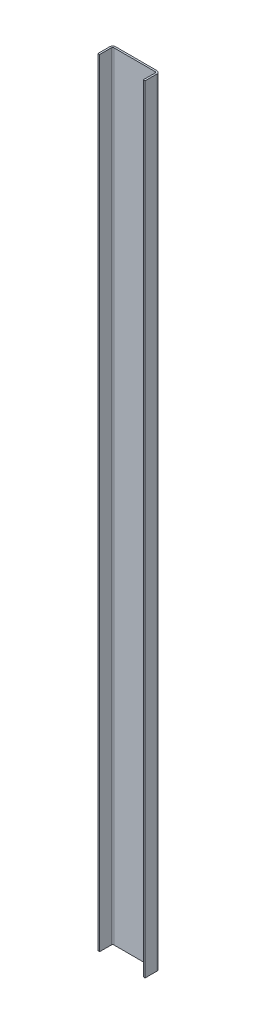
ISO-10303-21;
HEADER;
FILE_DESCRIPTION(('STEP AP214'),'2;1');
FILE_NAME('part.step','',(''),(''),'','','');
FILE_SCHEMA(('AUTOMOTIVE_DESIGN { 1 0 10303 214 1 1 1 1 }'));
ENDSEC;
DATA;
#1=APPLICATION_CONTEXT('core data for automotive mechanical design processes');
#2=APPLICATION_PROTOCOL_DEFINITION('international standard','automotive_design',2000,#1);
#3=PRODUCT_CONTEXT('',#1,'mechanical');
#4=PRODUCT('Part','Part','',(#3));
#5=PRODUCT_RELATED_PRODUCT_CATEGORY('part','',(#4));
#6=PRODUCT_DEFINITION_FORMATION('','',#4);
#7=PRODUCT_DEFINITION_CONTEXT('part definition',#1,'design');
#8=PRODUCT_DEFINITION('design','',#6,#7);
#9=PRODUCT_DEFINITION_SHAPE('','',#8);
#10=(LENGTH_UNIT() NAMED_UNIT(*) SI_UNIT(.MILLI.,.METRE.));
#11=(NAMED_UNIT(*) PLANE_ANGLE_UNIT() SI_UNIT($,.RADIAN.));
#12=(NAMED_UNIT(*) SI_UNIT($,.STERADIAN.) SOLID_ANGLE_UNIT());
#13=UNCERTAINTY_MEASURE_WITH_UNIT(LENGTH_MEASURE(1.E-05),#10,'distance_accuracy_value','');
#14=(GEOMETRIC_REPRESENTATION_CONTEXT(3) GLOBAL_UNCERTAINTY_ASSIGNED_CONTEXT((#13)) GLOBAL_UNIT_ASSIGNED_CONTEXT((#10,
#11,#12)) REPRESENTATION_CONTEXT('',''));
#15=CARTESIAN_POINT('',(0.,0.,0.));
#16=DIRECTION('',(0.,0.,1.));
#17=DIRECTION('',(1.,0.,0.));
#18=AXIS2_PLACEMENT_3D('',#15,#16,#17);
#19=CARTESIAN_POINT('',(40.,658.,0.));
#20=DIRECTION('',(-1.,0.,0.));
#21=DIRECTION('',(0.,0.,1.));
#22=AXIS2_PLACEMENT_3D('',#19,#20,#21);
#23=PLANE('',#22);
#24=DIRECTION('',(0.,1.,0.));
#25=VECTOR('',#24,1.);
#26=CARTESIAN_POINT('',(40.,658.,0.));
#27=LINE('',#26,#25);
#28=CARTESIAN_POINT('',(40.,658.,0.));
#29=VERTEX_POINT('',#28);
#30=CARTESIAN_POINT('',(40.,0.,0.));
#31=VERTEX_POINT('',#30);
#32=EDGE_CURVE('E147',#29,#31,#27,.F.);
#33=ORIENTED_EDGE('',*,*,#32,.T.);
#34=DIRECTION('',(0.,0.,1.));
#35=VECTOR('',#34,1.);
#36=CARTESIAN_POINT('',(40.,0.,0.));
#37=LINE('',#36,#35);
#38=CARTESIAN_POINT('',(40.,0.,-10.));
#39=VERTEX_POINT('',#38);
#40=EDGE_CURVE('E158',#31,#39,#37,.F.);
#41=ORIENTED_EDGE('',*,*,#40,.T.);
#42=DIRECTION('',(0.,1.,0.));
#43=VECTOR('',#42,1.);
#44=CARTESIAN_POINT('',(40.,658.,-10.));
#45=LINE('',#44,#43);
#46=CARTESIAN_POINT('',(40.,658.,-10.));
#47=VERTEX_POINT('',#46);
#48=EDGE_CURVE('E112',#47,#39,#45,.F.);
#49=ORIENTED_EDGE('',*,*,#48,.F.);
#50=DIRECTION('',(0.,0.,1.));
#51=VECTOR('',#50,1.);
#52=CARTESIAN_POINT('',(40.,658.,0.));
#53=LINE('',#52,#51);
#54=EDGE_CURVE('E119',#29,#47,#53,.F.);
#55=ORIENTED_EDGE('',*,*,#54,.F.);
#56=EDGE_LOOP('',(#33,#41,#49,#55));
#57=FACE_BOUND('',#56,.T.);
#58=ADVANCED_FACE('F17',(#57),#23,.F.);
#59=CARTESIAN_POINT('',(0.,658.,0.));
#60=DIRECTION('',(1.,0.,0.));
#61=DIRECTION('',(0.,0.,-1.));
#62=AXIS2_PLACEMENT_3D('',#59,#60,#61);
#63=PLANE('',#62);
#64=DIRECTION('',(0.,1.,0.));
#65=VECTOR('',#64,1.);
#66=CARTESIAN_POINT('',(0.,658.,0.));
#67=LINE('',#66,#65);
#68=CARTESIAN_POINT('',(0.,658.,0.));
#69=VERTEX_POINT('',#68);
#70=CARTESIAN_POINT('',(0.,0.,0.));
#71=VERTEX_POINT('',#70);
#72=EDGE_CURVE('E190',#69,#71,#67,.F.);
#73=ORIENTED_EDGE('',*,*,#72,.F.);
#74=DIRECTION('',(0.,0.,1.));
#75=VECTOR('',#74,1.);
#76=CARTESIAN_POINT('',(0.,658.,0.));
#77=LINE('',#76,#75);
#78=CARTESIAN_POINT('',(0.,658.,-10.));
#79=VERTEX_POINT('',#78);
#80=EDGE_CURVE('E194',#79,#69,#77,.T.);
#81=ORIENTED_EDGE('',*,*,#80,.F.);
#82=DIRECTION('',(0.,1.,0.));
#83=VECTOR('',#82,1.);
#84=CARTESIAN_POINT('',(0.,658.,-10.));
#85=LINE('',#84,#83);
#86=CARTESIAN_POINT('',(0.,0.,-10.));
#87=VERTEX_POINT('',#86);
#88=EDGE_CURVE('E108',#87,#79,#85,.T.);
#89=ORIENTED_EDGE('',*,*,#88,.F.);
#90=DIRECTION('',(0.,0.,1.));
#91=VECTOR('',#90,1.);
#92=CARTESIAN_POINT('',(0.,0.,0.));
#93=LINE('',#92,#91);
#94=EDGE_CURVE('E197',#87,#71,#93,.T.);
#95=ORIENTED_EDGE('',*,*,#94,.T.);
#96=EDGE_LOOP('',(#73,#81,#89,#95));
#97=FACE_BOUND('',#96,.T.);
#98=ADVANCED_FACE('F240',(#97),#63,.F.);
#99=CARTESIAN_POINT('',(38.5,658.,0.));
#100=DIRECTION('',(0.,0.,-1.));
#101=DIRECTION('',(-1.,0.,0.));
#102=AXIS2_PLACEMENT_3D('',#99,#100,#101);
#103=PLANE('',#102);
#104=ORIENTED_EDGE('',*,*,#32,.F.);
#105=DIRECTION('',(-1.,0.,0.));
#106=VECTOR('',#105,1.);
#107=CARTESIAN_POINT('',(38.5,658.,0.));
#108=LINE('',#107,#106);
#109=CARTESIAN_POINT('',(38.5,658.,0.));
#110=VERTEX_POINT('',#109);
#111=EDGE_CURVE('E150',#110,#29,#108,.F.);
#112=ORIENTED_EDGE('',*,*,#111,.F.);
#113=DIRECTION('',(0.,1.,0.));
#114=VECTOR('',#113,1.);
#115=CARTESIAN_POINT('',(38.5,658.,0.));
#116=LINE('',#115,#114);
#117=CARTESIAN_POINT('',(38.5,0.,0.));
#118=VERTEX_POINT('',#117);
#119=EDGE_CURVE('E133',#118,#110,#116,.T.);
#120=ORIENTED_EDGE('',*,*,#119,.F.);
#121=DIRECTION('',(-1.,0.,0.));
#122=VECTOR('',#121,1.);
#123=CARTESIAN_POINT('',(38.5,0.,0.));
#124=LINE('',#123,#122);
#125=EDGE_CURVE('E115',#31,#118,#124,.T.);
#126=ORIENTED_EDGE('',*,*,#125,.F.);
#127=EDGE_LOOP('',(#104,#112,#120,#126));
#128=FACE_BOUND('',#127,.T.);
#129=ADVANCED_FACE('F250',(#128),#103,.F.);
#130=CARTESIAN_POINT('',(37.5,658.,-10.));
#131=DIRECTION('',(0.,1.,0.));
#132=DIRECTION('',(0.,0.,1.));
#133=AXIS2_PLACEMENT_3D('',#130,#131,#132);
#134=CYLINDRICAL_SURFACE('',#133,2.5);
#135=CARTESIAN_POINT('',(37.5,0.,-10.));
#136=DIRECTION('',(0.,1.,0.));
#137=DIRECTION('',(0.,0.,1.));
#138=AXIS2_PLACEMENT_3D('',#135,#136,#137);
#139=CIRCLE('',#138,2.5);
#140=CARTESIAN_POINT('',(37.5,0.,-12.5));
#141=VERTEX_POINT('',#140);
#142=EDGE_CURVE('E110',#39,#141,#139,.T.);
#143=ORIENTED_EDGE('',*,*,#142,.T.);
#144=DIRECTION('',(0.,1.,0.));
#145=VECTOR('',#144,1.);
#146=CARTESIAN_POINT('',(37.5,658.,-12.5));
#147=LINE('',#146,#145);
#148=CARTESIAN_POINT('',(37.5,658.,-12.5));
#149=VERTEX_POINT('',#148);
#150=EDGE_CURVE('E187',#141,#149,#147,.T.);
#151=ORIENTED_EDGE('',*,*,#150,.T.);
#152=CARTESIAN_POINT('',(37.5,658.,-10.));
#153=DIRECTION('',(0.,1.,0.));
#154=DIRECTION('',(0.,0.,1.));
#155=AXIS2_PLACEMENT_3D('',#152,#153,#154);
#156=CIRCLE('',#155,2.5);
#157=EDGE_CURVE('E113',#149,#47,#156,.F.);
#158=ORIENTED_EDGE('',*,*,#157,.T.);
#159=ORIENTED_EDGE('',*,*,#48,.T.);
#160=EDGE_LOOP('',(#143,#151,#158,#159));
#161=FACE_BOUND('',#160,.T.);
#162=ADVANCED_FACE('F213',(#161),#134,.T.);
#163=CARTESIAN_POINT('',(2.5,658.,-10.));
#164=DIRECTION('',(0.,1.,0.));
#165=DIRECTION('',(0.,0.,1.));
#166=AXIS2_PLACEMENT_3D('',#163,#164,#165);
#167=CYLINDRICAL_SURFACE('',#166,2.5);
#168=CARTESIAN_POINT('',(2.5,0.,-10.));
#169=DIRECTION('',(0.,1.,0.));
#170=DIRECTION('',(0.,0.,1.));
#171=AXIS2_PLACEMENT_3D('',#168,#169,#170);
#172=CIRCLE('',#171,2.5);
#173=CARTESIAN_POINT('',(2.5,0.,-12.5));
#174=VERTEX_POINT('',#173);
#175=EDGE_CURVE('E105',#174,#87,#172,.T.);
#176=ORIENTED_EDGE('',*,*,#175,.T.);
#177=ORIENTED_EDGE('',*,*,#88,.T.);
#178=CARTESIAN_POINT('',(2.5,658.,-10.));
#179=DIRECTION('',(0.,1.,0.));
#180=DIRECTION('',(0.,0.,1.));
#181=AXIS2_PLACEMENT_3D('',#178,#179,#180);
#182=CIRCLE('',#181,2.5);
#183=CARTESIAN_POINT('',(2.5,658.,-12.5));
#184=VERTEX_POINT('',#183);
#185=EDGE_CURVE('E35',#79,#184,#182,.F.);
#186=ORIENTED_EDGE('',*,*,#185,.T.);
#187=DIRECTION('',(0.,1.,0.));
#188=VECTOR('',#187,1.);
#189=CARTESIAN_POINT('',(2.5,658.,-12.5));
#190=LINE('',#189,#188);
#191=EDGE_CURVE('E170',#184,#174,#190,.F.);
#192=ORIENTED_EDGE('',*,*,#191,.T.);
#193=EDGE_LOOP('',(#176,#177,#186,#192));
#194=FACE_BOUND('',#193,.T.);
#195=ADVANCED_FACE('F241',(#194),#167,.T.);
#196=CARTESIAN_POINT('',(1.5,658.,0.));
#197=DIRECTION('',(0.,0.,1.));
#198=DIRECTION('',(1.,0.,0.));
#199=AXIS2_PLACEMENT_3D('',#196,#197,#198);
#200=PLANE('',#199);
#201=DIRECTION('',(1.,0.,0.));
#202=VECTOR('',#201,1.);
#203=CARTESIAN_POINT('',(1.5,0.,0.));
#204=LINE('',#203,#202);
#205=CARTESIAN_POINT('',(1.5,0.,0.));
#206=VERTEX_POINT('',#205);
#207=EDGE_CURVE('E162',#71,#206,#204,.T.);
#208=ORIENTED_EDGE('',*,*,#207,.T.);
#209=DIRECTION('',(0.,1.,0.));
#210=VECTOR('',#209,1.);
#211=CARTESIAN_POINT('',(1.5,658.,0.));
#212=LINE('',#211,#210);
#213=CARTESIAN_POINT('',(1.5,658.,0.));
#214=VERTEX_POINT('',#213);
#215=EDGE_CURVE('E143',#214,#206,#212,.F.);
#216=ORIENTED_EDGE('',*,*,#215,.F.);
#217=DIRECTION('',(1.,0.,0.));
#218=VECTOR('',#217,1.);
#219=CARTESIAN_POINT('',(1.5,658.,0.));
#220=LINE('',#219,#218);
#221=EDGE_CURVE('E181',#214,#69,#220,.F.);
#222=ORIENTED_EDGE('',*,*,#221,.T.);
#223=ORIENTED_EDGE('',*,*,#72,.T.);
#224=EDGE_LOOP('',(#208,#216,#222,#223));
#225=FACE_BOUND('',#224,.T.);
#226=ADVANCED_FACE('F238',(#225),#200,.T.);
#227=CARTESIAN_POINT('',(38.5,658.,0.));
#228=DIRECTION('',(-1.,0.,0.));
#229=DIRECTION('',(0.,0.,1.));
#230=AXIS2_PLACEMENT_3D('',#227,#228,#229);
#231=PLANE('',#230);
#232=DIRECTION('',(0.,0.,1.));
#233=VECTOR('',#232,1.);
#234=CARTESIAN_POINT('',(38.5,0.,0.));
#235=LINE('',#234,#233);
#236=CARTESIAN_POINT('',(38.5,0.,-10.));
#237=VERTEX_POINT('',#236);
#238=EDGE_CURVE('E126',#237,#118,#235,.T.);
#239=ORIENTED_EDGE('',*,*,#238,.T.);
#240=ORIENTED_EDGE('',*,*,#119,.T.);
#241=DIRECTION('',(0.,0.,1.));
#242=VECTOR('',#241,1.);
#243=CARTESIAN_POINT('',(38.5,658.,0.));
#244=LINE('',#243,#242);
#245=CARTESIAN_POINT('',(38.5,658.,-10.));
#246=VERTEX_POINT('',#245);
#247=EDGE_CURVE('E134',#110,#246,#244,.F.);
#248=ORIENTED_EDGE('',*,*,#247,.T.);
#249=DIRECTION('',(0.,1.,0.));
#250=VECTOR('',#249,1.);
#251=CARTESIAN_POINT('',(38.5,658.,-10.));
#252=LINE('',#251,#250);
#253=EDGE_CURVE('E83',#246,#237,#252,.F.);
#254=ORIENTED_EDGE('',*,*,#253,.T.);
#255=EDGE_LOOP('',(#239,#240,#248,#254));
#256=FACE_BOUND('',#255,.T.);
#257=ADVANCED_FACE('F136',(#256),#231,.T.);
#258=CARTESIAN_POINT('',(0.,658.,-12.5));
#259=DIRECTION('',(0.,0.,1.));
#260=DIRECTION('',(1.,0.,0.));
#261=AXIS2_PLACEMENT_3D('',#258,#259,#260);
#262=PLANE('',#261);
#263=ORIENTED_EDGE('',*,*,#191,.F.);
#264=DIRECTION('',(1.,0.,0.));
#265=VECTOR('',#264,1.);
#266=CARTESIAN_POINT('',(0.,658.,-12.5));
#267=LINE('',#266,#265);
#268=EDGE_CURVE('E137',#149,#184,#267,.F.);
#269=ORIENTED_EDGE('',*,*,#268,.F.);
#270=ORIENTED_EDGE('',*,*,#150,.F.);
#271=DIRECTION('',(1.,0.,0.));
#272=VECTOR('',#271,1.);
#273=CARTESIAN_POINT('',(0.,0.,-12.5));
#274=LINE('',#273,#272);
#275=EDGE_CURVE('E138',#141,#174,#274,.F.);
#276=ORIENTED_EDGE('',*,*,#275,.T.);
#277=EDGE_LOOP('',(#263,#269,#270,#276));
#278=FACE_BOUND('',#277,.T.);
#279=ADVANCED_FACE('F218',(#278),#262,.F.);
#280=CARTESIAN_POINT('',(1.5,658.,0.));
#281=DIRECTION('',(1.,0.,0.));
#282=DIRECTION('',(0.,0.,-1.));
#283=AXIS2_PLACEMENT_3D('',#280,#281,#282);
#284=PLANE('',#283);
#285=DIRECTION('',(0.,0.,-1.));
#286=VECTOR('',#285,1.);
#287=CARTESIAN_POINT('',(1.5,658.,0.));
#288=LINE('',#287,#286);
#289=CARTESIAN_POINT('',(1.5,658.,-10.));
#290=VERTEX_POINT('',#289);
#291=EDGE_CURVE('E102',#290,#214,#288,.F.);
#292=ORIENTED_EDGE('',*,*,#291,.T.);
#293=ORIENTED_EDGE('',*,*,#215,.T.);
#294=DIRECTION('',(0.,0.,-1.));
#295=VECTOR('',#294,1.);
#296=CARTESIAN_POINT('',(1.5,0.,0.));
#297=LINE('',#296,#295);
#298=CARTESIAN_POINT('',(1.5,0.,-10.));
#299=VERTEX_POINT('',#298);
#300=EDGE_CURVE('E168',#206,#299,#297,.T.);
#301=ORIENTED_EDGE('',*,*,#300,.T.);
#302=DIRECTION('',(0.,1.,0.));
#303=VECTOR('',#302,1.);
#304=CARTESIAN_POINT('',(1.5,658.,-10.));
#305=LINE('',#304,#303);
#306=EDGE_CURVE('E140',#299,#290,#305,.T.);
#307=ORIENTED_EDGE('',*,*,#306,.T.);
#308=EDGE_LOOP('',(#292,#293,#301,#307));
#309=FACE_BOUND('',#308,.T.);
#310=ADVANCED_FACE('F174',(#309),#284,.T.);
#311=CARTESIAN_POINT('',(0.,0.,-11.));
#312=DIRECTION('',(0.,1.,0.));
#313=DIRECTION('',(0.,0.,1.));
#314=AXIS2_PLACEMENT_3D('',#311,#312,#313);
#315=PLANE('',#314);
#316=ORIENTED_EDGE('',*,*,#275,.F.);
#317=ORIENTED_EDGE('',*,*,#142,.F.);
#318=ORIENTED_EDGE('',*,*,#40,.F.);
#319=ORIENTED_EDGE('',*,*,#125,.T.);
#320=ORIENTED_EDGE('',*,*,#238,.F.);
#321=CARTESIAN_POINT('',(37.5,0.,-10.));
#322=DIRECTION('',(0.,1.,0.));
#323=DIRECTION('',(0.,0.,1.));
#324=AXIS2_PLACEMENT_3D('',#321,#322,#323);
#325=CIRCLE('',#324,1.);
#326=CARTESIAN_POINT('',(37.5,0.,-11.));
#327=VERTEX_POINT('',#326);
#328=EDGE_CURVE('E88',#237,#327,#325,.T.);
#329=ORIENTED_EDGE('',*,*,#328,.T.);
#330=DIRECTION('',(1.,0.,0.));
#331=VECTOR('',#330,1.);
#332=CARTESIAN_POINT('',(0.,0.,-11.));
#333=LINE('',#332,#331);
#334=CARTESIAN_POINT('',(2.5,0.,-11.));
#335=VERTEX_POINT('',#334);
#336=EDGE_CURVE('E93',#335,#327,#333,.T.);
#337=ORIENTED_EDGE('',*,*,#336,.F.);
#338=CARTESIAN_POINT('',(2.5,0.,-10.));
#339=DIRECTION('',(0.,1.,0.));
#340=DIRECTION('',(0.,0.,1.));
#341=AXIS2_PLACEMENT_3D('',#338,#339,#340);
#342=CIRCLE('',#341,1.);
#343=EDGE_CURVE('E116',#335,#299,#342,.T.);
#344=ORIENTED_EDGE('',*,*,#343,.T.);
#345=ORIENTED_EDGE('',*,*,#300,.F.);
#346=ORIENTED_EDGE('',*,*,#207,.F.);
#347=ORIENTED_EDGE('',*,*,#94,.F.);
#348=ORIENTED_EDGE('',*,*,#175,.F.);
#349=EDGE_LOOP('',(#316,#317,#318,#319,#320,#329,#337,#344,#345,#346,#347,#348));
#350=FACE_BOUND('',#349,.T.);
#351=ADVANCED_FACE('F123',(#350),#315,.F.);
#352=CARTESIAN_POINT('',(37.5,658.,-10.));
#353=DIRECTION('',(0.,1.,0.));
#354=DIRECTION('',(0.,0.,1.));
#355=AXIS2_PLACEMENT_3D('',#352,#353,#354);
#356=CYLINDRICAL_SURFACE('',#355,1.);
#357=DIRECTION('',(0.,1.,0.));
#358=VECTOR('',#357,1.);
#359=CARTESIAN_POINT('',(37.5,658.,-11.));
#360=LINE('',#359,#358);
#361=CARTESIAN_POINT('',(37.5,658.,-11.));
#362=VERTEX_POINT('',#361);
#363=EDGE_CURVE('E80',#327,#362,#360,.T.);
#364=ORIENTED_EDGE('',*,*,#363,.F.);
#365=ORIENTED_EDGE('',*,*,#328,.F.);
#366=ORIENTED_EDGE('',*,*,#253,.F.);
#367=CARTESIAN_POINT('',(37.5,658.,-10.));
#368=DIRECTION('',(0.,1.,0.));
#369=DIRECTION('',(0.,0.,1.));
#370=AXIS2_PLACEMENT_3D('',#367,#368,#369);
#371=CIRCLE('',#370,1.);
#372=EDGE_CURVE('E20',#362,#246,#371,.F.);
#373=ORIENTED_EDGE('',*,*,#372,.F.);
#374=EDGE_LOOP('',(#364,#365,#366,#373));
#375=FACE_BOUND('',#374,.T.);
#376=ADVANCED_FACE('F79',(#375),#356,.F.);
#377=CARTESIAN_POINT('',(0.,658.,-11.));
#378=DIRECTION('',(0.,1.,0.));
#379=DIRECTION('',(0.,0.,1.));
#380=AXIS2_PLACEMENT_3D('',#377,#378,#379);
#381=PLANE('',#380);
#382=ORIENTED_EDGE('',*,*,#268,.T.);
#383=ORIENTED_EDGE('',*,*,#185,.F.);
#384=ORIENTED_EDGE('',*,*,#80,.T.);
#385=ORIENTED_EDGE('',*,*,#221,.F.);
#386=ORIENTED_EDGE('',*,*,#291,.F.);
#387=CARTESIAN_POINT('',(2.5,658.,-10.));
#388=DIRECTION('',(0.,1.,0.));
#389=DIRECTION('',(0.,0.,1.));
#390=AXIS2_PLACEMENT_3D('',#387,#388,#389);
#391=CIRCLE('',#390,1.);
#392=CARTESIAN_POINT('',(2.5,658.,-11.));
#393=VERTEX_POINT('',#392);
#394=EDGE_CURVE('E99',#290,#393,#391,.F.);
#395=ORIENTED_EDGE('',*,*,#394,.T.);
#396=DIRECTION('',(1.,0.,0.));
#397=VECTOR('',#396,1.);
#398=CARTESIAN_POINT('',(0.,658.,-11.));
#399=LINE('',#398,#397);
#400=EDGE_CURVE('E26',#362,#393,#399,.F.);
#401=ORIENTED_EDGE('',*,*,#400,.F.);
#402=ORIENTED_EDGE('',*,*,#372,.T.);
#403=ORIENTED_EDGE('',*,*,#247,.F.);
#404=ORIENTED_EDGE('',*,*,#111,.T.);
#405=ORIENTED_EDGE('',*,*,#54,.T.);
#406=ORIENTED_EDGE('',*,*,#157,.F.);
#407=EDGE_LOOP('',(#382,#383,#384,#385,#386,#395,#401,#402,#403,#404,#405,#406));
#408=FACE_BOUND('',#407,.T.);
#409=ADVANCED_FACE('F97',(#408),#381,.T.);
#410=CARTESIAN_POINT('',(2.5,658.,-10.));
#411=DIRECTION('',(0.,1.,0.));
#412=DIRECTION('',(0.,0.,1.));
#413=AXIS2_PLACEMENT_3D('',#410,#411,#412);
#414=CYLINDRICAL_SURFACE('',#413,1.);
#415=ORIENTED_EDGE('',*,*,#306,.F.);
#416=ORIENTED_EDGE('',*,*,#343,.F.);
#417=DIRECTION('',(0.,1.,0.));
#418=VECTOR('',#417,1.);
#419=CARTESIAN_POINT('',(2.5,658.,-11.));
#420=LINE('',#419,#418);
#421=EDGE_CURVE('E11',#393,#335,#420,.F.);
#422=ORIENTED_EDGE('',*,*,#421,.F.);
#423=ORIENTED_EDGE('',*,*,#394,.F.);
#424=EDGE_LOOP('',(#415,#416,#422,#423));
#425=FACE_BOUND('',#424,.T.);
#426=ADVANCED_FACE('F253',(#425),#414,.F.);
#427=CARTESIAN_POINT('',(0.,658.,-11.));
#428=DIRECTION('',(0.,0.,1.));
#429=DIRECTION('',(1.,0.,0.));
#430=AXIS2_PLACEMENT_3D('',#427,#428,#429);
#431=PLANE('',#430);
#432=ORIENTED_EDGE('',*,*,#400,.T.);
#433=ORIENTED_EDGE('',*,*,#421,.T.);
#434=ORIENTED_EDGE('',*,*,#336,.T.);
#435=ORIENTED_EDGE('',*,*,#363,.T.);
#436=EDGE_LOOP('',(#432,#433,#434,#435));
#437=FACE_BOUND('',#436,.T.);
#438=ADVANCED_FACE('F90',(#437),#431,.T.);
#439=CLOSED_SHELL('',(#58,#98,#129,#162,#195,#226,#257,#279,#310,#351,#376,#409,#426,#438));
#440=MANIFOLD_SOLID_BREP('B1',#439);
#441=ADVANCED_BREP_SHAPE_REPRESENTATION('',(#18,#440),#14);
#442=SHAPE_DEFINITION_REPRESENTATION(#9,#441);
ENDSEC;
END-ISO-10303-21;
